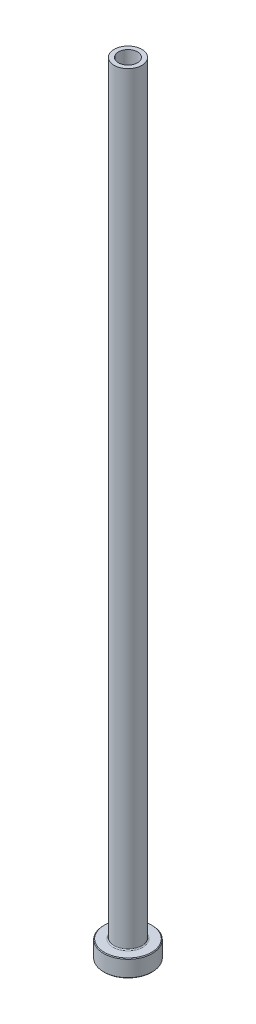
from build123d import *

# Parameters (mm, degrees)
FILLET1_R     = 0.3
CHAMFER1_SIZE = 0.2
CHAMFER3_SIZE = 0.5


with BuildPart() as part:
    # Sketch1 → Revolve1 (revolve)
    with BuildSketch(Plane.XY, mode=Mode.PRIVATE) as revolve1_sk:
        Polygon((-2.75, 225), (-4, 225), (-4, 5), (-7, 5), (-7, 0), (-3, 0), (-3, 168), (-2.75, 180), align=None)
    revolve(revolve1_sk.sketch.rotate(Axis((0, 92.187680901, 0), (0, -1, 0)), 270), axis=Axis((0, 92.187680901, 0), (0, -1, 0)))

    # Fillet1
    fillet1_edges = [part.edges().sort_by_distance(p)[0] for p in [
        (0, 5, -4),
    ]]
    fillet(fillet1_edges, radius=FILLET1_R)

    # Chamfer1
    chamfer1_edges = [part.edges().sort_by_distance(p)[0] for p in [
        (0, 0, -7),
        (0, 5, -7),
    ]]
    chamfer(chamfer1_edges, length=CHAMFER1_SIZE)

    # Chamfer3
    chamfer3_edges = [part.edges().sort_by_distance(p)[0] for p in [
        (0, 0, -3),
    ]]
    chamfer(chamfer3_edges, length=CHAMFER3_SIZE)


solid = part.part
